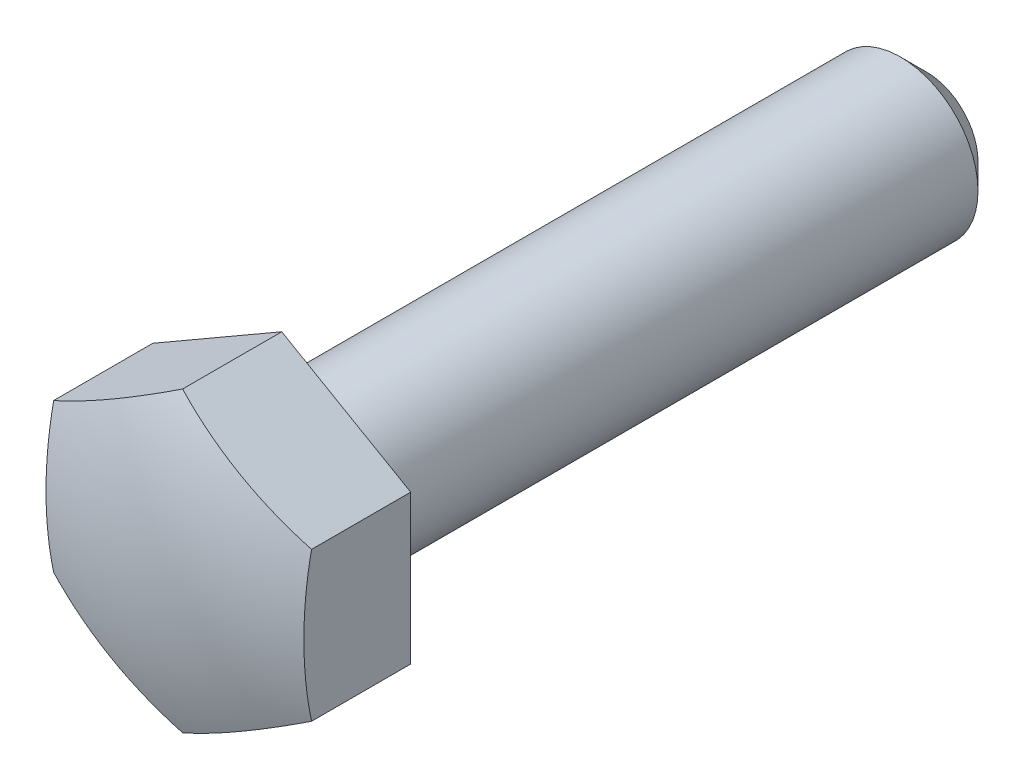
ISO-10303-21;
HEADER;
FILE_DESCRIPTION(('STEP AP214'),'2;1');
FILE_NAME('part.step','',(''),(''),'','','');
FILE_SCHEMA(('AUTOMOTIVE_DESIGN { 1 0 10303 214 1 1 1 1 }'));
ENDSEC;
DATA;
#1=APPLICATION_CONTEXT('core data for automotive mechanical design processes');
#2=APPLICATION_PROTOCOL_DEFINITION('international standard','automotive_design',2000,#1);
#3=PRODUCT_CONTEXT('',#1,'mechanical');
#4=PRODUCT('Part','Part','',(#3));
#5=PRODUCT_RELATED_PRODUCT_CATEGORY('part','',(#4));
#6=PRODUCT_DEFINITION_FORMATION('','',#4);
#7=PRODUCT_DEFINITION_CONTEXT('part definition',#1,'design');
#8=PRODUCT_DEFINITION('design','',#6,#7);
#9=PRODUCT_DEFINITION_SHAPE('','',#8);
#10=(LENGTH_UNIT() NAMED_UNIT(*) SI_UNIT(.MILLI.,.METRE.));
#11=(NAMED_UNIT(*) PLANE_ANGLE_UNIT() SI_UNIT($,.RADIAN.));
#12=(NAMED_UNIT(*) SI_UNIT($,.STERADIAN.) SOLID_ANGLE_UNIT());
#13=UNCERTAINTY_MEASURE_WITH_UNIT(LENGTH_MEASURE(1.E-05),#10,'distance_accuracy_value','');
#14=(GEOMETRIC_REPRESENTATION_CONTEXT(3) GLOBAL_UNCERTAINTY_ASSIGNED_CONTEXT((#13)) GLOBAL_UNIT_ASSIGNED_CONTEXT((#10,
#11,#12)) REPRESENTATION_CONTEXT('',''));
#15=CARTESIAN_POINT('',(0.,0.,0.));
#16=DIRECTION('',(0.,0.,1.));
#17=DIRECTION('',(1.,0.,0.));
#18=AXIS2_PLACEMENT_3D('',#15,#16,#17);
#19=CARTESIAN_POINT('',(3.,0.,0.));
#20=DIRECTION('',(0.,0.,1.));
#21=DIRECTION('',(1.,0.,0.));
#22=AXIS2_PLACEMENT_3D('',#19,#20,#21);
#23=PLANE('',#22);
#24=CARTESIAN_POINT('',(0.,0.,0.));
#25=DIRECTION('',(0.,0.,1.));
#26=DIRECTION('',(1.,0.,0.));
#27=AXIS2_PLACEMENT_3D('',#24,#25,#26);
#28=CIRCLE('',#27,3.);
#29=CARTESIAN_POINT('',(3.,0.,0.));
#30=VERTEX_POINT('',#29);
#31=EDGE_CURVE('E115',#30,#30,#28,.T.);
#32=ORIENTED_EDGE('',*,*,#31,.T.);
#33=EDGE_LOOP('',(#32));
#34=FACE_BOUND('',#33,.T.);
#35=DIRECTION('',(-0.86602540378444,-0.5,0.));
#36=VECTOR('',#35,1.);
#37=CARTESIAN_POINT('',(5.,-2.88675134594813,0.));
#38=LINE('',#37,#36);
#39=CARTESIAN_POINT('',(5.,-2.88675134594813,0.));
#40=VERTEX_POINT('',#39);
#41=CARTESIAN_POINT('',(0.,-5.77350269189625,0.));
#42=VERTEX_POINT('',#41);
#43=EDGE_CURVE('E89',#40,#42,#38,.T.);
#44=ORIENTED_EDGE('',*,*,#43,.T.);
#45=DIRECTION('',(0.86602540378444,-0.5,0.));
#46=VECTOR('',#45,1.);
#47=CARTESIAN_POINT('',(-5.,-2.88675134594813,0.));
#48=LINE('',#47,#46);
#49=CARTESIAN_POINT('',(-5.,-2.88675134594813,0.));
#50=VERTEX_POINT('',#49);
#51=EDGE_CURVE('E87',#50,#42,#48,.T.);
#52=ORIENTED_EDGE('',*,*,#51,.F.);
#53=DIRECTION('',(0.,-1.,0.));
#54=VECTOR('',#53,1.);
#55=CARTESIAN_POINT('',(-5.,2.88675134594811,0.));
#56=LINE('',#55,#54);
#57=CARTESIAN_POINT('',(-5.,2.88675134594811,0.));
#58=VERTEX_POINT('',#57);
#59=EDGE_CURVE('E37',#58,#50,#56,.T.);
#60=ORIENTED_EDGE('',*,*,#59,.F.);
#61=DIRECTION('',(0.866025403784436,0.5,0.));
#62=VECTOR('',#61,1.);
#63=CARTESIAN_POINT('',(-5.,2.88675134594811,0.));
#64=LINE('',#63,#62);
#65=CARTESIAN_POINT('',(0.,5.77350269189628,0.));
#66=VERTEX_POINT('',#65);
#67=EDGE_CURVE('E77',#58,#66,#64,.T.);
#68=ORIENTED_EDGE('',*,*,#67,.T.);
#69=DIRECTION('',(-0.866025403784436,0.5,0.));
#70=VECTOR('',#69,1.);
#71=CARTESIAN_POINT('',(5.,2.88675134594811,0.));
#72=LINE('',#71,#70);
#73=CARTESIAN_POINT('',(5.,2.88675134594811,0.));
#74=VERTEX_POINT('',#73);
#75=EDGE_CURVE('E83',#74,#66,#72,.T.);
#76=ORIENTED_EDGE('',*,*,#75,.F.);
#77=DIRECTION('',(0.,-1.,0.));
#78=VECTOR('',#77,1.);
#79=CARTESIAN_POINT('',(5.,2.88675134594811,0.));
#80=LINE('',#79,#78);
#81=EDGE_CURVE('E95',#74,#40,#80,.T.);
#82=ORIENTED_EDGE('',*,*,#81,.T.);
#83=EDGE_LOOP('',(#44,#52,#60,#68,#76,#82));
#84=FACE_BOUND('',#83,.T.);
#85=ADVANCED_FACE('F14',(#34,#84),#23,.F.);
#86=CARTESIAN_POINT('',(0.,0.,35.));
#87=DIRECTION('',(0.,0.,1.));
#88=DIRECTION('',(1.,0.,0.));
#89=AXIS2_PLACEMENT_3D('',#86,#87,#88);
#90=CYLINDRICAL_SURFACE('',#89,3.);
#91=CARTESIAN_POINT('',(0.,0.,-24.));
#92=DIRECTION('',(0.,0.,1.));
#93=DIRECTION('',(1.,0.,0.));
#94=AXIS2_PLACEMENT_3D('',#91,#92,#93);
#95=CIRCLE('',#94,3.);
#96=CARTESIAN_POINT('',(3.,0.,-24.));
#97=VERTEX_POINT('',#96);
#98=EDGE_CURVE('E22',#97,#97,#95,.T.);
#99=ORIENTED_EDGE('',*,*,#98,.T.);
#100=EDGE_LOOP('',(#99));
#101=FACE_BOUND('',#100,.T.);
#102=ORIENTED_EDGE('',*,*,#31,.F.);
#103=EDGE_LOOP('',(#102));
#104=FACE_BOUND('',#103,.T.);
#105=ADVANCED_FACE('F120',(#101,#104),#90,.T.);
#106=CARTESIAN_POINT('',(0.,0.,-25.));
#107=DIRECTION('',(0.,0.,1.));
#108=DIRECTION('',(1.,0.,0.));
#109=AXIS2_PLACEMENT_3D('',#106,#107,#108);
#110=PLANE('',#109);
#111=CARTESIAN_POINT('',(0.,0.,-25.));
#112=DIRECTION('',(0.,0.,1.));
#113=DIRECTION('',(1.,0.,0.));
#114=AXIS2_PLACEMENT_3D('',#111,#112,#113);
#115=CIRCLE('',#114,2.);
#116=CARTESIAN_POINT('',(2.,0.,-25.));
#117=VERTEX_POINT('',#116);
#118=EDGE_CURVE('E9',#117,#117,#115,.F.);
#119=ORIENTED_EDGE('',*,*,#118,.T.);
#120=EDGE_LOOP('',(#119));
#121=FACE_BOUND('',#120,.T.);
#122=ADVANCED_FACE('F141',(#121),#110,.F.);
#123=CARTESIAN_POINT('',(5.,-2.88675134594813,5.));
#124=DIRECTION('',(0.5,-0.86602540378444,0.));
#125=DIRECTION('',(0.86602540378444,0.5,0.));
#126=AXIS2_PLACEMENT_3D('',#123,#124,#125);
#127=PLANE('',#126);
#128=DIRECTION('',(0.,0.,-1.));
#129=VECTOR('',#128,1.);
#130=CARTESIAN_POINT('',(0.,-5.77350269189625,5.));
#131=LINE('',#130,#129);
#132=CARTESIAN_POINT('',(0.,-5.77350269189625,3.84437310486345));
#133=VERTEX_POINT('',#132);
#134=EDGE_CURVE('E29',#133,#42,#131,.T.);
#135=ORIENTED_EDGE('',*,*,#134,.T.);
#136=ORIENTED_EDGE('',*,*,#43,.F.);
#137=DIRECTION('',(0.,0.,-1.));
#138=VECTOR('',#137,1.);
#139=CARTESIAN_POINT('',(5.,-2.88675134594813,5.));
#140=LINE('',#139,#138);
#141=CARTESIAN_POINT('',(5.,-2.88675134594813,3.84437310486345));
#142=VERTEX_POINT('',#141);
#143=EDGE_CURVE('E100',#142,#40,#140,.T.);
#144=ORIENTED_EDGE('',*,*,#143,.F.);
#145=CARTESIAN_POINT('',(2.5,-4.3301270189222,-10.));
#146=DIRECTION('',(0.5,-0.86602540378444,0.));
#147=DIRECTION('',(0.86602540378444,0.5,0.));
#148=AXIS2_PLACEMENT_3D('',#145,#146,#147);
#149=CIRCLE('',#148,14.1421356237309);
#150=EDGE_CURVE('E112',#133,#142,#149,.F.);
#151=ORIENTED_EDGE('',*,*,#150,.F.);
#152=EDGE_LOOP('',(#135,#136,#144,#151));
#153=FACE_BOUND('',#152,.T.);
#154=ADVANCED_FACE('F146',(#153),#127,.T.);
#155=CARTESIAN_POINT('',(5.,2.88675134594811,5.));
#156=DIRECTION('',(1.,0.,0.));
#157=DIRECTION('',(0.,0.,-1.));
#158=AXIS2_PLACEMENT_3D('',#155,#156,#157);
#159=PLANE('',#158);
#160=ORIENTED_EDGE('',*,*,#143,.T.);
#161=ORIENTED_EDGE('',*,*,#81,.F.);
#162=DIRECTION('',(0.,0.,-1.));
#163=VECTOR('',#162,1.);
#164=CARTESIAN_POINT('',(5.,2.88675134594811,5.));
#165=LINE('',#164,#163);
#166=CARTESIAN_POINT('',(5.,2.88675134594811,3.84437310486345));
#167=VERTEX_POINT('',#166);
#168=EDGE_CURVE('E98',#167,#74,#165,.T.);
#169=ORIENTED_EDGE('',*,*,#168,.F.);
#170=CARTESIAN_POINT('',(5.,0.,-10.));
#171=DIRECTION('',(1.,0.,0.));
#172=DIRECTION('',(0.,0.,-1.));
#173=AXIS2_PLACEMENT_3D('',#170,#171,#172);
#174=CIRCLE('',#173,14.1421356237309);
#175=EDGE_CURVE('E109',#142,#167,#174,.F.);
#176=ORIENTED_EDGE('',*,*,#175,.F.);
#177=EDGE_LOOP('',(#160,#161,#169,#176));
#178=FACE_BOUND('',#177,.T.);
#179=ADVANCED_FACE('F148',(#178),#159,.T.);
#180=CARTESIAN_POINT('',(5.,2.88675134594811,5.));
#181=DIRECTION('',(-0.5,-0.866025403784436,0.));
#182=DIRECTION('',(0.866025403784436,-0.5,0.));
#183=AXIS2_PLACEMENT_3D('',#180,#181,#182);
#184=PLANE('',#183);
#185=CARTESIAN_POINT('',(2.5,4.33012701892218,-10.));
#186=DIRECTION('',(-0.5,-0.866025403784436,0.));
#187=DIRECTION('',(0.866025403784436,-0.5,0.));
#188=AXIS2_PLACEMENT_3D('',#185,#186,#187);
#189=CIRCLE('',#188,14.1421356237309);
#190=CARTESIAN_POINT('',(0.,5.77350269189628,3.84437310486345));
#191=VERTEX_POINT('',#190);
#192=EDGE_CURVE('E107',#191,#167,#189,.F.);
#193=ORIENTED_EDGE('',*,*,#192,.T.);
#194=ORIENTED_EDGE('',*,*,#168,.T.);
#195=ORIENTED_EDGE('',*,*,#75,.T.);
#196=DIRECTION('',(0.,0.,-1.));
#197=VECTOR('',#196,1.);
#198=CARTESIAN_POINT('',(0.,5.77350269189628,5.));
#199=LINE('',#198,#197);
#200=EDGE_CURVE('E73',#191,#66,#199,.T.);
#201=ORIENTED_EDGE('',*,*,#200,.F.);
#202=EDGE_LOOP('',(#193,#194,#195,#201));
#203=FACE_BOUND('',#202,.T.);
#204=ADVANCED_FACE('F151',(#203),#184,.F.);
#205=CARTESIAN_POINT('',(-5.,2.88675134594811,5.));
#206=DIRECTION('',(-0.5,0.866025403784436,0.));
#207=DIRECTION('',(-0.866025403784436,-0.5,0.));
#208=AXIS2_PLACEMENT_3D('',#205,#206,#207);
#209=PLANE('',#208);
#210=ORIENTED_EDGE('',*,*,#200,.T.);
#211=ORIENTED_EDGE('',*,*,#67,.F.);
#212=DIRECTION('',(0.,0.,-1.));
#213=VECTOR('',#212,1.);
#214=CARTESIAN_POINT('',(-5.,2.88675134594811,5.));
#215=LINE('',#214,#213);
#216=CARTESIAN_POINT('',(-5.,2.88675134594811,3.84437310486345));
#217=VERTEX_POINT('',#216);
#218=EDGE_CURVE('E66',#217,#58,#215,.T.);
#219=ORIENTED_EDGE('',*,*,#218,.F.);
#220=CARTESIAN_POINT('',(-2.5,4.33012701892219,-10.));
#221=DIRECTION('',(-0.5,0.866025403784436,0.));
#222=DIRECTION('',(-0.866025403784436,-0.5,0.));
#223=AXIS2_PLACEMENT_3D('',#220,#221,#222);
#224=CIRCLE('',#223,14.1421356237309);
#225=EDGE_CURVE('E105',#191,#217,#224,.F.);
#226=ORIENTED_EDGE('',*,*,#225,.F.);
#227=EDGE_LOOP('',(#210,#211,#219,#226));
#228=FACE_BOUND('',#227,.T.);
#229=ADVANCED_FACE('F78',(#228),#209,.T.);
#230=CARTESIAN_POINT('',(-5.,2.88675134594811,5.));
#231=DIRECTION('',(1.,0.,0.));
#232=DIRECTION('',(0.,1.,0.));
#233=AXIS2_PLACEMENT_3D('',#230,#231,#232);
#234=PLANE('',#233);
#235=CARTESIAN_POINT('',(-5.,0.,-10.));
#236=DIRECTION('',(1.,0.,0.));
#237=DIRECTION('',(0.,1.,0.));
#238=AXIS2_PLACEMENT_3D('',#235,#236,#237);
#239=CIRCLE('',#238,14.1421356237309);
#240=CARTESIAN_POINT('',(-5.,-2.88675134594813,3.84437310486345));
#241=VERTEX_POINT('',#240);
#242=EDGE_CURVE('E70',#241,#217,#239,.F.);
#243=ORIENTED_EDGE('',*,*,#242,.T.);
#244=ORIENTED_EDGE('',*,*,#218,.T.);
#245=ORIENTED_EDGE('',*,*,#59,.T.);
#246=DIRECTION('',(0.,0.,-1.));
#247=VECTOR('',#246,1.);
#248=CARTESIAN_POINT('',(-5.,-2.88675134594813,5.));
#249=LINE('',#248,#247);
#250=EDGE_CURVE('E74',#241,#50,#249,.T.);
#251=ORIENTED_EDGE('',*,*,#250,.F.);
#252=EDGE_LOOP('',(#243,#244,#245,#251));
#253=FACE_BOUND('',#252,.T.);
#254=ADVANCED_FACE('F68',(#253),#234,.F.);
#255=CARTESIAN_POINT('',(-5.,-2.88675134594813,5.));
#256=DIRECTION('',(0.5,0.86602540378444,0.));
#257=DIRECTION('',(-0.86602540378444,0.5,0.));
#258=AXIS2_PLACEMENT_3D('',#255,#256,#257);
#259=PLANE('',#258);
#260=CARTESIAN_POINT('',(-2.5,-4.3301270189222,-10.));
#261=DIRECTION('',(0.5,0.86602540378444,0.));
#262=DIRECTION('',(-0.86602540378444,0.5,0.));
#263=AXIS2_PLACEMENT_3D('',#260,#261,#262);
#264=CIRCLE('',#263,14.1421356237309);
#265=EDGE_CURVE('E102',#133,#241,#264,.F.);
#266=ORIENTED_EDGE('',*,*,#265,.T.);
#267=ORIENTED_EDGE('',*,*,#250,.T.);
#268=ORIENTED_EDGE('',*,*,#51,.T.);
#269=ORIENTED_EDGE('',*,*,#134,.F.);
#270=EDGE_LOOP('',(#266,#267,#268,#269));
#271=FACE_BOUND('',#270,.T.);
#272=ADVANCED_FACE('F131',(#271),#259,.F.);
#273=CARTESIAN_POINT('',(0.,0.,-10.));
#274=DIRECTION('',(0.,0.,1.));
#275=DIRECTION('',(1.,0.,0.));
#276=AXIS2_PLACEMENT_3D('',#273,#274,#275);
#277=SPHERICAL_SURFACE('',#276,15.);
#278=ORIENTED_EDGE('',*,*,#265,.F.);
#279=ORIENTED_EDGE('',*,*,#150,.T.);
#280=ORIENTED_EDGE('',*,*,#175,.T.);
#281=ORIENTED_EDGE('',*,*,#192,.F.);
#282=ORIENTED_EDGE('',*,*,#225,.T.);
#283=ORIENTED_EDGE('',*,*,#242,.F.);
#284=EDGE_LOOP('',(#278,#279,#280,#281,#282,#283));
#285=FACE_BOUND('',#284,.T.);
#286=ADVANCED_FACE('F124',(#285),#277,.T.);
#287=CARTESIAN_POINT('',(0.,0.,-24.));
#288=DIRECTION('',(0.,0.,1.));
#289=DIRECTION('',(1.,0.,0.));
#290=AXIS2_PLACEMENT_3D('',#287,#288,#289);
#291=CONICAL_SURFACE('',#290,3.,0.78539816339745);
#292=ORIENTED_EDGE('',*,*,#118,.F.);
#293=EDGE_LOOP('',(#292));
#294=FACE_BOUND('',#293,.T.);
#295=ORIENTED_EDGE('',*,*,#98,.F.);
#296=EDGE_LOOP('',(#295));
#297=FACE_BOUND('',#296,.T.);
#298=ADVANCED_FACE('F16',(#294,#297),#291,.T.);
#299=CLOSED_SHELL('',(#85,#105,#122,#154,#179,#204,#229,#254,#272,#286,#298));
#300=MANIFOLD_SOLID_BREP('B1',#299);
#301=ADVANCED_BREP_SHAPE_REPRESENTATION('',(#18,#300),#14);
#302=SHAPE_DEFINITION_REPRESENTATION(#9,#301);
ENDSEC;
END-ISO-10303-21;
